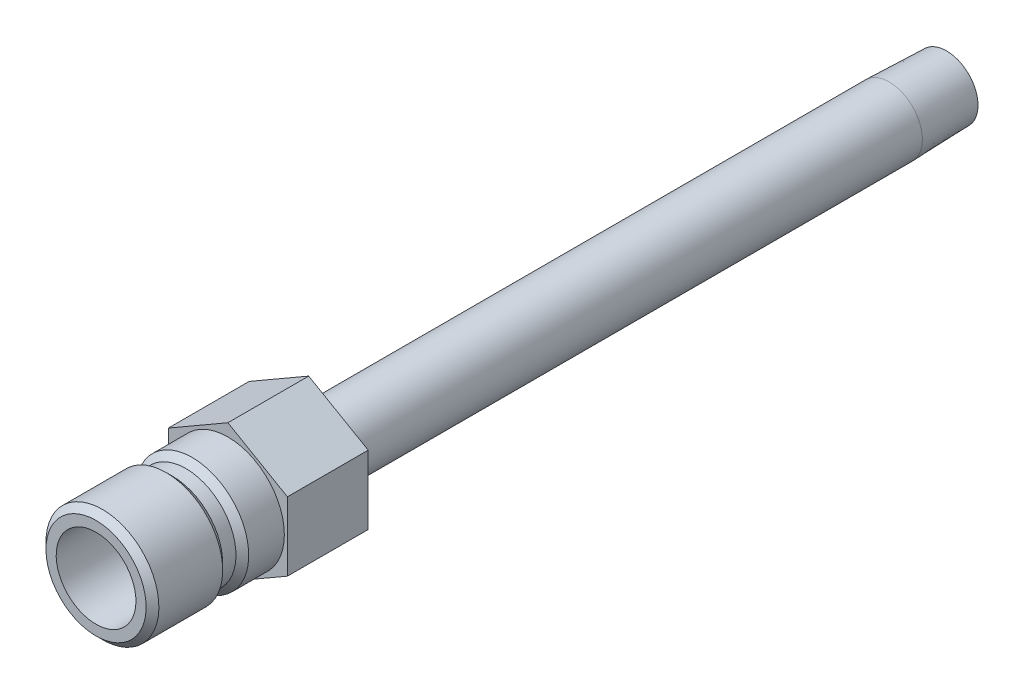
ISO-10303-21;
HEADER;
FILE_DESCRIPTION(('STEP AP214'),'2;1');
FILE_NAME('part.step','',(''),(''),'','','');
FILE_SCHEMA(('AUTOMOTIVE_DESIGN { 1 0 10303 214 1 1 1 1 }'));
ENDSEC;
DATA;
#1=APPLICATION_CONTEXT('core data for automotive mechanical design processes');
#2=APPLICATION_PROTOCOL_DEFINITION('international standard','automotive_design',2000,#1);
#3=PRODUCT_CONTEXT('',#1,'mechanical');
#4=PRODUCT('Part','Part','',(#3));
#5=PRODUCT_RELATED_PRODUCT_CATEGORY('part','',(#4));
#6=PRODUCT_DEFINITION_FORMATION('','',#4);
#7=PRODUCT_DEFINITION_CONTEXT('part definition',#1,'design');
#8=PRODUCT_DEFINITION('design','',#6,#7);
#9=PRODUCT_DEFINITION_SHAPE('','',#8);
#10=(LENGTH_UNIT() NAMED_UNIT(*) SI_UNIT(.MILLI.,.METRE.));
#11=(NAMED_UNIT(*) PLANE_ANGLE_UNIT() SI_UNIT($,.RADIAN.));
#12=(NAMED_UNIT(*) SI_UNIT($,.STERADIAN.) SOLID_ANGLE_UNIT());
#13=UNCERTAINTY_MEASURE_WITH_UNIT(LENGTH_MEASURE(1.E-05),#10,'distance_accuracy_value','');
#14=(GEOMETRIC_REPRESENTATION_CONTEXT(3) GLOBAL_UNCERTAINTY_ASSIGNED_CONTEXT((#13)) GLOBAL_UNIT_ASSIGNED_CONTEXT((#10,
#11,#12)) REPRESENTATION_CONTEXT('',''));
#15=CARTESIAN_POINT('',(0.,0.,0.));
#16=DIRECTION('',(0.,0.,1.));
#17=DIRECTION('',(1.,0.,0.));
#18=AXIS2_PLACEMENT_3D('',#15,#16,#17);
#19=CARTESIAN_POINT('',(0.,0.,-9.652));
#20=DIRECTION('',(0.,0.,-1.));
#21=DIRECTION('',(0.,1.,0.));
#22=AXIS2_PLACEMENT_3D('',#19,#20,#21);
#23=CYLINDRICAL_SURFACE('',#22,2.6543);
#24=CARTESIAN_POINT('',(0.,0.,2.43505017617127));
#25=DIRECTION('',(0.,0.,-1.));
#26=DIRECTION('',(0.,1.,0.));
#27=AXIS2_PLACEMENT_3D('',#24,#25,#26);
#28=CIRCLE('',#27,2.6543);
#29=CARTESIAN_POINT('',(0.,2.6543,2.43505017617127));
#30=VERTEX_POINT('',#29);
#31=EDGE_CURVE('E41',#30,#30,#28,.T.);
#32=ORIENTED_EDGE('',*,*,#31,.F.);
#33=EDGE_LOOP('',(#32));
#34=FACE_BOUND('',#33,.T.);
#35=CARTESIAN_POINT('',(0.,0.,-85.852));
#36=DIRECTION('',(0.,0.,-1.));
#37=DIRECTION('',(0.,1.,0.));
#38=AXIS2_PLACEMENT_3D('',#35,#36,#37);
#39=CIRCLE('',#38,2.65430000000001);
#40=CARTESIAN_POINT('',(0.,2.65430000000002,-85.852));
#41=VERTEX_POINT('',#40);
#42=EDGE_CURVE('E137',#41,#41,#39,.T.);
#43=ORIENTED_EDGE('',*,*,#42,.T.);
#44=EDGE_LOOP('',(#43));
#45=FACE_BOUND('',#44,.T.);
#46=ADVANCED_FACE('F33',(#34,#45),#23,.F.);
#47=CARTESIAN_POINT('',(0.,0.,3.556));
#48=DIRECTION('',(0.,0.,1.));
#49=DIRECTION('',(0.,-1.,0.));
#50=AXIS2_PLACEMENT_3D('',#47,#48,#49);
#51=CONICAL_SURFACE('',#50,4.7625,1.08210413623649);
#52=ORIENTED_EDGE('',*,*,#31,.T.);
#53=EDGE_LOOP('',(#52));
#54=FACE_BOUND('',#53,.T.);
#55=CARTESIAN_POINT('',(0.,0.,3.556));
#56=DIRECTION('',(0.,0.,-1.));
#57=DIRECTION('',(0.,1.,0.));
#58=AXIS2_PLACEMENT_3D('',#55,#56,#57);
#59=CIRCLE('',#58,4.7625);
#60=CARTESIAN_POINT('',(0.,4.7625,3.556));
#61=VERTEX_POINT('',#60);
#62=EDGE_CURVE('E175',#61,#61,#59,.T.);
#63=ORIENTED_EDGE('',*,*,#62,.F.);
#64=EDGE_LOOP('',(#63));
#65=FACE_BOUND('',#64,.T.);
#66=ADVANCED_FACE('F180',(#54,#65),#51,.F.);
#67=CARTESIAN_POINT('',(0.,0.,-9.652));
#68=DIRECTION('',(0.,0.,-1.));
#69=DIRECTION('',(0.,1.,0.));
#70=AXIS2_PLACEMENT_3D('',#67,#68,#69);
#71=CYLINDRICAL_SURFACE('',#70,4.7625);
#72=ORIENTED_EDGE('',*,*,#62,.T.);
#73=EDGE_LOOP('',(#72));
#74=FACE_BOUND('',#73,.T.);
#75=CARTESIAN_POINT('',(0.,0.,15.748));
#76=DIRECTION('',(0.,0.,-1.));
#77=DIRECTION('',(0.,1.,0.));
#78=AXIS2_PLACEMENT_3D('',#75,#76,#77);
#79=CIRCLE('',#78,4.7625);
#80=CARTESIAN_POINT('',(0.,4.7625,15.748));
#81=VERTEX_POINT('',#80);
#82=EDGE_CURVE('E172',#81,#81,#79,.T.);
#83=ORIENTED_EDGE('',*,*,#82,.F.);
#84=EDGE_LOOP('',(#83));
#85=FACE_BOUND('',#84,.T.);
#86=ADVANCED_FACE('F237',(#74,#85),#71,.F.);
#87=CARTESIAN_POINT('',(0.,4.7625,15.748));
#88=DIRECTION('',(0.,0.,1.));
#89=DIRECTION('',(0.,-1.,0.));
#90=AXIS2_PLACEMENT_3D('',#87,#88,#89);
#91=PLANE('',#90);
#92=ORIENTED_EDGE('',*,*,#82,.T.);
#93=EDGE_LOOP('',(#92));
#94=FACE_BOUND('',#93,.T.);
#95=CARTESIAN_POINT('',(0.,0.,15.748));
#96=DIRECTION('',(0.,0.,-1.));
#97=DIRECTION('',(0.,1.,0.));
#98=AXIS2_PLACEMENT_3D('',#95,#96,#97);
#99=CIRCLE('',#98,5.9817);
#100=CARTESIAN_POINT('',(0.,5.9817,15.748));
#101=VERTEX_POINT('',#100);
#102=EDGE_CURVE('E169',#101,#101,#99,.T.);
#103=ORIENTED_EDGE('',*,*,#102,.F.);
#104=EDGE_LOOP('',(#103));
#105=FACE_BOUND('',#104,.T.);
#106=ADVANCED_FACE('F233',(#94,#105),#91,.T.);
#107=CARTESIAN_POINT('',(0.,0.,14.986));
#108=DIRECTION('',(0.,0.,-1.));
#109=DIRECTION('',(0.,1.,0.));
#110=AXIS2_PLACEMENT_3D('',#107,#108,#109);
#111=CONICAL_SURFACE('',#110,6.7437,0.785398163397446);
#112=ORIENTED_EDGE('',*,*,#102,.T.);
#113=EDGE_LOOP('',(#112));
#114=FACE_BOUND('',#113,.T.);
#115=CARTESIAN_POINT('',(0.,0.,14.986));
#116=DIRECTION('',(0.,0.,-1.));
#117=DIRECTION('',(0.,1.,0.));
#118=AXIS2_PLACEMENT_3D('',#115,#116,#117);
#119=CIRCLE('',#118,6.7437);
#120=CARTESIAN_POINT('',(0.,6.7437,14.986));
#121=VERTEX_POINT('',#120);
#122=EDGE_CURVE('E166',#121,#121,#119,.T.);
#123=ORIENTED_EDGE('',*,*,#122,.F.);
#124=EDGE_LOOP('',(#123));
#125=FACE_BOUND('',#124,.T.);
#126=ADVANCED_FACE('F229',(#114,#125),#111,.T.);
#127=CARTESIAN_POINT('',(0.,0.,-9.652));
#128=DIRECTION('',(0.,0.,-1.));
#129=DIRECTION('',(0.,1.,0.));
#130=AXIS2_PLACEMENT_3D('',#127,#128,#129);
#131=CYLINDRICAL_SURFACE('',#130,6.7437);
#132=ORIENTED_EDGE('',*,*,#122,.T.);
#133=EDGE_LOOP('',(#132));
#134=FACE_BOUND('',#133,.T.);
#135=CARTESIAN_POINT('',(0.,0.,7.366));
#136=DIRECTION('',(0.,0.,-1.));
#137=DIRECTION('',(0.,1.,0.));
#138=AXIS2_PLACEMENT_3D('',#135,#136,#137);
#139=CIRCLE('',#138,6.7437);
#140=CARTESIAN_POINT('',(0.,6.7437,7.366));
#141=VERTEX_POINT('',#140);
#142=EDGE_CURVE('E163',#141,#141,#139,.T.);
#143=ORIENTED_EDGE('',*,*,#142,.F.);
#144=EDGE_LOOP('',(#143));
#145=FACE_BOUND('',#144,.T.);
#146=ADVANCED_FACE('F225',(#134,#145),#131,.T.);
#147=CARTESIAN_POINT('',(0.,0.,6.604));
#148=DIRECTION('',(0.,0.,1.));
#149=DIRECTION('',(0.,-1.,0.));
#150=AXIS2_PLACEMENT_3D('',#147,#148,#149);
#151=CONICAL_SURFACE('',#150,5.9817,0.785398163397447);
#152=ORIENTED_EDGE('',*,*,#142,.T.);
#153=EDGE_LOOP('',(#152));
#154=FACE_BOUND('',#153,.T.);
#155=CARTESIAN_POINT('',(0.,0.,6.604));
#156=DIRECTION('',(0.,0.,-1.));
#157=DIRECTION('',(0.,1.,0.));
#158=AXIS2_PLACEMENT_3D('',#155,#156,#157);
#159=CIRCLE('',#158,5.9817);
#160=CARTESIAN_POINT('',(0.,5.9817,6.604));
#161=VERTEX_POINT('',#160);
#162=EDGE_CURVE('E160',#161,#161,#159,.T.);
#163=ORIENTED_EDGE('',*,*,#162,.F.);
#164=EDGE_LOOP('',(#163));
#165=FACE_BOUND('',#164,.T.);
#166=ADVANCED_FACE('F221',(#154,#165),#151,.T.);
#167=CARTESIAN_POINT('',(0.,0.,-9.652));
#168=DIRECTION('',(0.,0.,-1.));
#169=DIRECTION('',(0.,1.,0.));
#170=AXIS2_PLACEMENT_3D('',#167,#168,#169);
#171=CYLINDRICAL_SURFACE('',#170,5.9817);
#172=ORIENTED_EDGE('',*,*,#162,.T.);
#173=EDGE_LOOP('',(#172));
#174=FACE_BOUND('',#173,.T.);
#175=CARTESIAN_POINT('',(0.,0.,5.0165));
#176=DIRECTION('',(0.,0.,-1.));
#177=DIRECTION('',(0.,1.,0.));
#178=AXIS2_PLACEMENT_3D('',#175,#176,#177);
#179=CIRCLE('',#178,5.9817);
#180=CARTESIAN_POINT('',(0.,5.9817,5.0165));
#181=VERTEX_POINT('',#180);
#182=EDGE_CURVE('E157',#181,#181,#179,.T.);
#183=ORIENTED_EDGE('',*,*,#182,.F.);
#184=EDGE_LOOP('',(#183));
#185=FACE_BOUND('',#184,.T.);
#186=ADVANCED_FACE('F217',(#174,#185),#171,.T.);
#187=CARTESIAN_POINT('',(0.,0.,4.25449999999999));
#188=DIRECTION('',(0.,0.,-1.));
#189=DIRECTION('',(0.,1.,0.));
#190=AXIS2_PLACEMENT_3D('',#187,#188,#189);
#191=CONICAL_SURFACE('',#190,6.7437,0.785398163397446);
#192=ORIENTED_EDGE('',*,*,#182,.T.);
#193=EDGE_LOOP('',(#192));
#194=FACE_BOUND('',#193,.T.);
#195=CARTESIAN_POINT('',(0.,0.,4.25449999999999));
#196=DIRECTION('',(0.,0.,-1.));
#197=DIRECTION('',(0.,1.,0.));
#198=AXIS2_PLACEMENT_3D('',#195,#196,#197);
#199=CIRCLE('',#198,6.7437);
#200=CARTESIAN_POINT('',(0.,6.7437,4.25449999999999));
#201=VERTEX_POINT('',#200);
#202=EDGE_CURVE('E154',#201,#201,#199,.T.);
#203=ORIENTED_EDGE('',*,*,#202,.F.);
#204=EDGE_LOOP('',(#203));
#205=FACE_BOUND('',#204,.T.);
#206=ADVANCED_FACE('F213',(#194,#205),#191,.T.);
#207=CARTESIAN_POINT('',(0.,0.,-9.652));
#208=DIRECTION('',(0.,0.,-1.));
#209=DIRECTION('',(0.,1.,0.));
#210=AXIS2_PLACEMENT_3D('',#207,#208,#209);
#211=CYLINDRICAL_SURFACE('',#210,6.7437);
#212=CARTESIAN_POINT('',(0.,0.,0.));
#213=DIRECTION('',(0.,0.,1.));
#214=DIRECTION('',(1.,0.,0.));
#215=AXIS2_PLACEMENT_3D('',#212,#213,#214);
#216=CIRCLE('',#215,6.7437);
#217=CARTESIAN_POINT('',(6.7437,0.,0.));
#218=VERTEX_POINT('',#217);
#219=EDGE_CURVE('E11',#218,#218,#216,.F.);
#220=ORIENTED_EDGE('',*,*,#219,.F.);
#221=EDGE_LOOP('',(#220));
#222=FACE_BOUND('',#221,.T.);
#223=ORIENTED_EDGE('',*,*,#202,.T.);
#224=EDGE_LOOP('',(#223));
#225=FACE_BOUND('',#224,.T.);
#226=ADVANCED_FACE('F209',(#222,#225),#211,.T.);
#227=CARTESIAN_POINT('',(0.,6.7437,-9.652));
#228=DIRECTION('',(0.,0.,-1.));
#229=DIRECTION('',(0.,1.,0.));
#230=AXIS2_PLACEMENT_3D('',#227,#228,#229);
#231=PLANE('',#230);
#232=CARTESIAN_POINT('',(0.,0.,-9.652));
#233=DIRECTION('',(0.,0.,-1.));
#234=DIRECTION('',(0.,1.,0.));
#235=AXIS2_PLACEMENT_3D('',#232,#233,#234);
#236=CIRCLE('',#235,3.96875);
#237=CARTESIAN_POINT('',(0.,3.96875,-9.652));
#238=VERTEX_POINT('',#237);
#239=EDGE_CURVE('E151',#238,#238,#236,.T.);
#240=ORIENTED_EDGE('',*,*,#239,.F.);
#241=EDGE_LOOP('',(#240));
#242=FACE_BOUND('',#241,.T.);
#243=DIRECTION('',(-0.866025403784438,-0.5,0.));
#244=VECTOR('',#243,1.);
#245=CARTESIAN_POINT('',(0.,8.21223022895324,-9.652));
#246=LINE('',#245,#244);
#247=CARTESIAN_POINT('',(0.,8.21223022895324,-9.652));
#248=VERTEX_POINT('',#247);
#249=CARTESIAN_POINT('',(-7.112,4.10611511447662,-9.652));
#250=VERTEX_POINT('',#249);
#251=EDGE_CURVE('E135',#248,#250,#246,.T.);
#252=ORIENTED_EDGE('',*,*,#251,.F.);
#253=DIRECTION('',(-0.866025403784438,0.5,0.));
#254=VECTOR('',#253,1.);
#255=CARTESIAN_POINT('',(7.112,4.10611511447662,-9.652));
#256=LINE('',#255,#254);
#257=CARTESIAN_POINT('',(7.112,4.10611511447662,-9.652));
#258=VERTEX_POINT('',#257);
#259=EDGE_CURVE('E110',#258,#248,#256,.T.);
#260=ORIENTED_EDGE('',*,*,#259,.F.);
#261=DIRECTION('',(0.,1.,0.));
#262=VECTOR('',#261,1.);
#263=CARTESIAN_POINT('',(7.112,-4.10611511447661,-9.652));
#264=LINE('',#263,#262);
#265=CARTESIAN_POINT('',(7.112,-4.10611511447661,-9.652));
#266=VERTEX_POINT('',#265);
#267=EDGE_CURVE('E95',#266,#258,#264,.T.);
#268=ORIENTED_EDGE('',*,*,#267,.F.);
#269=DIRECTION('',(0.866025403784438,0.5,0.));
#270=VECTOR('',#269,1.);
#271=CARTESIAN_POINT('',(0.,-8.21223022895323,-9.652));
#272=LINE('',#271,#270);
#273=CARTESIAN_POINT('',(0.,-8.21223022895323,-9.652));
#274=VERTEX_POINT('',#273);
#275=EDGE_CURVE('E108',#274,#266,#272,.T.);
#276=ORIENTED_EDGE('',*,*,#275,.F.);
#277=DIRECTION('',(0.866025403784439,-0.5,0.));
#278=VECTOR('',#277,1.);
#279=CARTESIAN_POINT('',(-7.112,-4.10611511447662,-9.652));
#280=LINE('',#279,#278);
#281=CARTESIAN_POINT('',(-7.112,-4.10611511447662,-9.652));
#282=VERTEX_POINT('',#281);
#283=EDGE_CURVE('E113',#282,#274,#280,.T.);
#284=ORIENTED_EDGE('',*,*,#283,.F.);
#285=DIRECTION('',(0.,-1.,0.));
#286=VECTOR('',#285,1.);
#287=CARTESIAN_POINT('',(-7.112,4.10611511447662,-9.652));
#288=LINE('',#287,#286);
#289=EDGE_CURVE('E115',#250,#282,#288,.T.);
#290=ORIENTED_EDGE('',*,*,#289,.F.);
#291=EDGE_LOOP('',(#252,#260,#268,#276,#284,#290));
#292=FACE_BOUND('',#291,.T.);
#293=ADVANCED_FACE('F106',(#242,#292),#231,.T.);
#294=CARTESIAN_POINT('',(0.,0.,-9.652));
#295=DIRECTION('',(0.,0.,-1.));
#296=DIRECTION('',(0.,1.,0.));
#297=AXIS2_PLACEMENT_3D('',#294,#295,#296);
#298=CYLINDRICAL_SURFACE('',#297,3.96875);
#299=ORIENTED_EDGE('',*,*,#239,.T.);
#300=EDGE_LOOP('',(#299));
#301=FACE_BOUND('',#300,.T.);
#302=CARTESIAN_POINT('',(0.,0.,-78.994));
#303=DIRECTION('',(0.,0.,-1.));
#304=DIRECTION('',(0.,1.,0.));
#305=AXIS2_PLACEMENT_3D('',#302,#303,#304);
#306=CIRCLE('',#305,3.96874999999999);
#307=CARTESIAN_POINT('',(0.,3.96875,-78.994));
#308=VERTEX_POINT('',#307);
#309=EDGE_CURVE('E148',#308,#308,#306,.T.);
#310=ORIENTED_EDGE('',*,*,#309,.F.);
#311=EDGE_LOOP('',(#310));
#312=FACE_BOUND('',#311,.T.);
#313=ADVANCED_FACE('F199',(#301,#312),#298,.T.);
#314=CARTESIAN_POINT('',(0.,0.,-85.852));
#315=DIRECTION('',(0.,0.,1.));
#316=DIRECTION('',(0.,-1.,0.));
#317=AXIS2_PLACEMENT_3D('',#314,#315,#316);
#318=CONICAL_SURFACE('',#317,3.75443877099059,0.0312396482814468);
#319=ORIENTED_EDGE('',*,*,#309,.T.);
#320=EDGE_LOOP('',(#319));
#321=FACE_BOUND('',#320,.T.);
#322=CARTESIAN_POINT('',(0.,0.,-85.852));
#323=DIRECTION('',(0.,0.,-1.));
#324=DIRECTION('',(0.,1.,0.));
#325=AXIS2_PLACEMENT_3D('',#322,#323,#324);
#326=CIRCLE('',#325,3.75443877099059);
#327=CARTESIAN_POINT('',(0.,3.7544387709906,-85.852));
#328=VERTEX_POINT('',#327);
#329=EDGE_CURVE('E145',#328,#328,#326,.T.);
#330=ORIENTED_EDGE('',*,*,#329,.F.);
#331=EDGE_LOOP('',(#330));
#332=FACE_BOUND('',#331,.T.);
#333=ADVANCED_FACE('F190',(#321,#332),#318,.T.);
#334=CARTESIAN_POINT('',(0.,3.7544387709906,-85.852));
#335=DIRECTION('',(0.,0.,-1.));
#336=DIRECTION('',(0.,1.,0.));
#337=AXIS2_PLACEMENT_3D('',#334,#335,#336);
#338=PLANE('',#337);
#339=ORIENTED_EDGE('',*,*,#329,.T.);
#340=EDGE_LOOP('',(#339));
#341=FACE_BOUND('',#340,.T.);
#342=ORIENTED_EDGE('',*,*,#42,.F.);
#343=EDGE_LOOP('',(#342));
#344=FACE_BOUND('',#343,.T.);
#345=ADVANCED_FACE('F187',(#341,#344),#338,.T.);
#346=CARTESIAN_POINT('',(0.,8.21223022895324,-9.652));
#347=DIRECTION('',(-0.5,0.866025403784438,0.));
#348=DIRECTION('',(-0.866025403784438,-0.5,0.));
#349=AXIS2_PLACEMENT_3D('',#346,#347,#348);
#350=PLANE('',#349);
#351=DIRECTION('',(-0.866025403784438,-0.5,0.));
#352=VECTOR('',#351,1.);
#353=CARTESIAN_POINT('',(0.,8.21223022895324,0.));
#354=LINE('',#353,#352);
#355=CARTESIAN_POINT('',(0.,8.21223022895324,0.));
#356=VERTEX_POINT('',#355);
#357=CARTESIAN_POINT('',(-7.112,4.10611511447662,0.));
#358=VERTEX_POINT('',#357);
#359=EDGE_CURVE('E120',#356,#358,#354,.T.);
#360=ORIENTED_EDGE('',*,*,#359,.F.);
#361=DIRECTION('',(0.,0.,1.));
#362=VECTOR('',#361,1.);
#363=CARTESIAN_POINT('',(0.,8.21223022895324,-9.652));
#364=LINE('',#363,#362);
#365=EDGE_CURVE('E49',#248,#356,#364,.T.);
#366=ORIENTED_EDGE('',*,*,#365,.F.);
#367=ORIENTED_EDGE('',*,*,#251,.T.);
#368=DIRECTION('',(0.,0.,1.));
#369=VECTOR('',#368,1.);
#370=CARTESIAN_POINT('',(-7.112,4.10611511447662,-9.652));
#371=LINE('',#370,#369);
#372=EDGE_CURVE('E84',#250,#358,#371,.T.);
#373=ORIENTED_EDGE('',*,*,#372,.T.);
#374=EDGE_LOOP('',(#360,#366,#367,#373));
#375=FACE_BOUND('',#374,.T.);
#376=ADVANCED_FACE('F189',(#375),#350,.T.);
#377=CARTESIAN_POINT('',(7.112,4.10611511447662,-9.652));
#378=DIRECTION('',(0.5,0.866025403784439,0.));
#379=DIRECTION('',(-0.866025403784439,0.5,0.));
#380=AXIS2_PLACEMENT_3D('',#377,#378,#379);
#381=PLANE('',#380);
#382=DIRECTION('',(-0.866025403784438,0.5,0.));
#383=VECTOR('',#382,1.);
#384=CARTESIAN_POINT('',(7.112,4.10611511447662,0.));
#385=LINE('',#384,#383);
#386=CARTESIAN_POINT('',(7.112,4.10611511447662,0.));
#387=VERTEX_POINT('',#386);
#388=EDGE_CURVE('E132',#387,#356,#385,.T.);
#389=ORIENTED_EDGE('',*,*,#388,.F.);
#390=DIRECTION('',(0.,0.,1.));
#391=VECTOR('',#390,1.);
#392=CARTESIAN_POINT('',(7.112,4.10611511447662,-9.652));
#393=LINE('',#392,#391);
#394=EDGE_CURVE('E72',#258,#387,#393,.T.);
#395=ORIENTED_EDGE('',*,*,#394,.F.);
#396=ORIENTED_EDGE('',*,*,#259,.T.);
#397=ORIENTED_EDGE('',*,*,#365,.T.);
#398=EDGE_LOOP('',(#389,#395,#396,#397));
#399=FACE_BOUND('',#398,.T.);
#400=ADVANCED_FACE('F197',(#399),#381,.T.);
#401=CARTESIAN_POINT('',(7.112,-4.10611511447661,-9.652));
#402=DIRECTION('',(1.,0.,0.));
#403=DIRECTION('',(0.,1.,0.));
#404=AXIS2_PLACEMENT_3D('',#401,#402,#403);
#405=PLANE('',#404);
#406=DIRECTION('',(0.,1.,0.));
#407=VECTOR('',#406,1.);
#408=CARTESIAN_POINT('',(7.112,-4.10611511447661,0.));
#409=LINE('',#408,#407);
#410=CARTESIAN_POINT('',(7.112,-4.10611511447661,0.));
#411=VERTEX_POINT('',#410);
#412=EDGE_CURVE('E97',#411,#387,#409,.T.);
#413=ORIENTED_EDGE('',*,*,#412,.F.);
#414=DIRECTION('',(0.,0.,1.));
#415=VECTOR('',#414,1.);
#416=CARTESIAN_POINT('',(7.112,-4.10611511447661,-9.652));
#417=LINE('',#416,#415);
#418=EDGE_CURVE('E92',#266,#411,#417,.T.);
#419=ORIENTED_EDGE('',*,*,#418,.F.);
#420=ORIENTED_EDGE('',*,*,#267,.T.);
#421=ORIENTED_EDGE('',*,*,#394,.T.);
#422=EDGE_LOOP('',(#413,#419,#420,#421));
#423=FACE_BOUND('',#422,.T.);
#424=ADVANCED_FACE('F94',(#423),#405,.T.);
#425=CARTESIAN_POINT('',(0.,-8.21223022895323,-9.652));
#426=DIRECTION('',(0.5,-0.866025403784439,0.));
#427=DIRECTION('',(0.866025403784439,0.5,0.));
#428=AXIS2_PLACEMENT_3D('',#425,#426,#427);
#429=PLANE('',#428);
#430=DIRECTION('',(0.866025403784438,0.5,0.));
#431=VECTOR('',#430,1.);
#432=CARTESIAN_POINT('',(0.,-8.21223022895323,0.));
#433=LINE('',#432,#431);
#434=CARTESIAN_POINT('',(0.,-8.21223022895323,0.));
#435=VERTEX_POINT('',#434);
#436=EDGE_CURVE('E129',#435,#411,#433,.T.);
#437=ORIENTED_EDGE('',*,*,#436,.F.);
#438=DIRECTION('',(0.,0.,1.));
#439=VECTOR('',#438,1.);
#440=CARTESIAN_POINT('',(0.,-8.21223022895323,-9.652));
#441=LINE('',#440,#439);
#442=EDGE_CURVE('E102',#274,#435,#441,.T.);
#443=ORIENTED_EDGE('',*,*,#442,.F.);
#444=ORIENTED_EDGE('',*,*,#275,.T.);
#445=ORIENTED_EDGE('',*,*,#418,.T.);
#446=EDGE_LOOP('',(#437,#443,#444,#445));
#447=FACE_BOUND('',#446,.T.);
#448=ADVANCED_FACE('F112',(#447),#429,.T.);
#449=CARTESIAN_POINT('',(-7.112,-4.10611511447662,-9.652));
#450=DIRECTION('',(-0.5,-0.866025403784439,0.));
#451=DIRECTION('',(0.866025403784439,-0.5,0.));
#452=AXIS2_PLACEMENT_3D('',#449,#450,#451);
#453=PLANE('',#452);
#454=DIRECTION('',(0.866025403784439,-0.5,0.));
#455=VECTOR('',#454,1.);
#456=CARTESIAN_POINT('',(-7.112,-4.10611511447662,0.));
#457=LINE('',#456,#455);
#458=CARTESIAN_POINT('',(-7.112,-4.10611511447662,0.));
#459=VERTEX_POINT('',#458);
#460=EDGE_CURVE('E126',#459,#435,#457,.T.);
#461=ORIENTED_EDGE('',*,*,#460,.F.);
#462=DIRECTION('',(0.,0.,1.));
#463=VECTOR('',#462,1.);
#464=CARTESIAN_POINT('',(-7.112,-4.10611511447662,-9.652));
#465=LINE('',#464,#463);
#466=EDGE_CURVE('E140',#282,#459,#465,.T.);
#467=ORIENTED_EDGE('',*,*,#466,.F.);
#468=ORIENTED_EDGE('',*,*,#283,.T.);
#469=ORIENTED_EDGE('',*,*,#442,.T.);
#470=EDGE_LOOP('',(#461,#467,#468,#469));
#471=FACE_BOUND('',#470,.T.);
#472=ADVANCED_FACE('F352',(#471),#453,.T.);
#473=CARTESIAN_POINT('',(-7.112,4.10611511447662,-9.652));
#474=DIRECTION('',(-1.,0.,0.));
#475=DIRECTION('',(0.,-1.,0.));
#476=AXIS2_PLACEMENT_3D('',#473,#474,#475);
#477=PLANE('',#476);
#478=DIRECTION('',(0.,-1.,0.));
#479=VECTOR('',#478,1.);
#480=CARTESIAN_POINT('',(-7.112,4.10611511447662,0.));
#481=LINE('',#480,#479);
#482=EDGE_CURVE('E123',#358,#459,#481,.T.);
#483=ORIENTED_EDGE('',*,*,#482,.F.);
#484=ORIENTED_EDGE('',*,*,#372,.F.);
#485=ORIENTED_EDGE('',*,*,#289,.T.);
#486=ORIENTED_EDGE('',*,*,#466,.T.);
#487=EDGE_LOOP('',(#483,#484,#485,#486));
#488=FACE_BOUND('',#487,.T.);
#489=ADVANCED_FACE('F360',(#488),#477,.T.);
#490=CARTESIAN_POINT('',(-7.112,4.10611511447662,0.));
#491=DIRECTION('',(0.,0.,1.));
#492=DIRECTION('',(1.,0.,0.));
#493=AXIS2_PLACEMENT_3D('',#490,#491,#492);
#494=PLANE('',#493);
#495=ORIENTED_EDGE('',*,*,#219,.T.);
#496=EDGE_LOOP('',(#495));
#497=FACE_BOUND('',#496,.T.);
#498=ORIENTED_EDGE('',*,*,#359,.T.);
#499=ORIENTED_EDGE('',*,*,#482,.T.);
#500=ORIENTED_EDGE('',*,*,#460,.T.);
#501=ORIENTED_EDGE('',*,*,#436,.T.);
#502=ORIENTED_EDGE('',*,*,#412,.T.);
#503=ORIENTED_EDGE('',*,*,#388,.T.);
#504=EDGE_LOOP('',(#498,#499,#500,#501,#502,#503));
#505=FACE_BOUND('',#504,.T.);
#506=ADVANCED_FACE('F369',(#497,#505),#494,.T.);
#507=CLOSED_SHELL('',(#46,#66,#86,#106,#126,#146,#166,#186,#206,#226,#293,#313,#333,#345,#376,
#400,#424,#448,#472,#489,#506));
#508=MANIFOLD_SOLID_BREP('B2',#507);
#509=ADVANCED_BREP_SHAPE_REPRESENTATION('',(#18,#508),#14);
#510=SHAPE_DEFINITION_REPRESENTATION(#9,#509);
ENDSEC;
END-ISO-10303-21;
